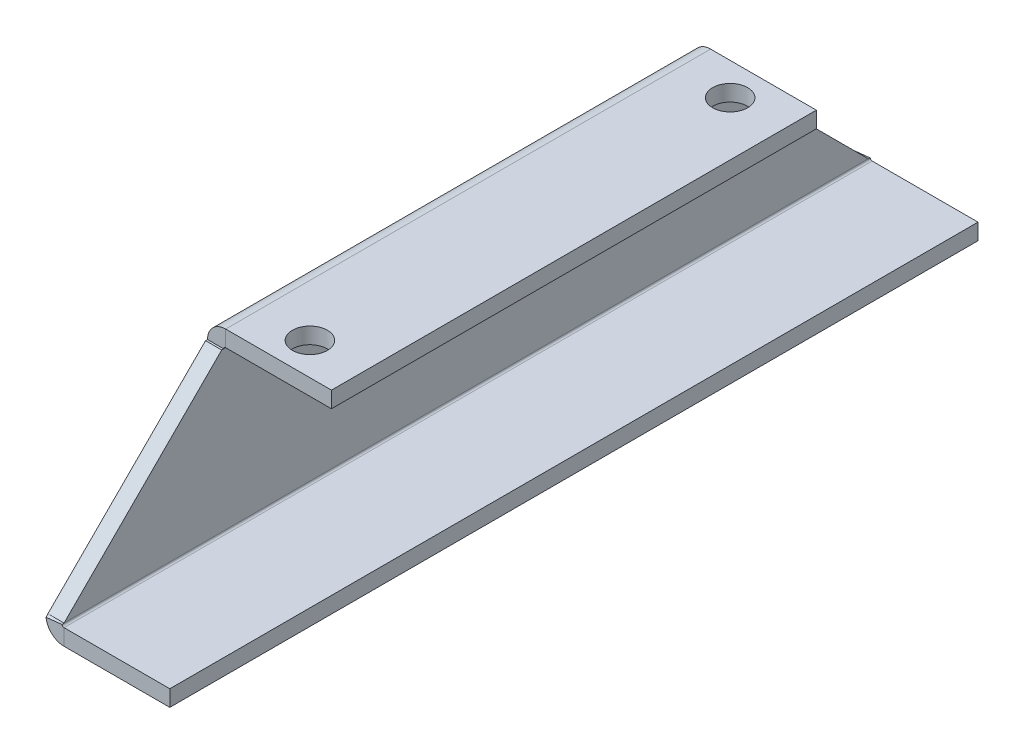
ISO-10303-21;
HEADER;
FILE_DESCRIPTION(('STEP AP214'),'2;1');
FILE_NAME('part.step','',(''),(''),'','','');
FILE_SCHEMA(('AUTOMOTIVE_DESIGN { 1 0 10303 214 1 1 1 1 }'));
ENDSEC;
DATA;
#1=APPLICATION_CONTEXT('core data for automotive mechanical design processes');
#2=APPLICATION_PROTOCOL_DEFINITION('international standard','automotive_design',2000,#1);
#3=PRODUCT_CONTEXT('',#1,'mechanical');
#4=PRODUCT('Part','Part','',(#3));
#5=PRODUCT_RELATED_PRODUCT_CATEGORY('part','',(#4));
#6=PRODUCT_DEFINITION_FORMATION('','',#4);
#7=PRODUCT_DEFINITION_CONTEXT('part definition',#1,'design');
#8=PRODUCT_DEFINITION('design','',#6,#7);
#9=PRODUCT_DEFINITION_SHAPE('','',#8);
#10=(LENGTH_UNIT() NAMED_UNIT(*) SI_UNIT(.MILLI.,.METRE.));
#11=(NAMED_UNIT(*) PLANE_ANGLE_UNIT() SI_UNIT($,.RADIAN.));
#12=(NAMED_UNIT(*) SI_UNIT($,.STERADIAN.) SOLID_ANGLE_UNIT());
#13=UNCERTAINTY_MEASURE_WITH_UNIT(LENGTH_MEASURE(1.E-05),#10,'distance_accuracy_value','');
#14=(GEOMETRIC_REPRESENTATION_CONTEXT(3) GLOBAL_UNCERTAINTY_ASSIGNED_CONTEXT((#13)) GLOBAL_UNIT_ASSIGNED_CONTEXT((#10,
#11,#12)) REPRESENTATION_CONTEXT('',''));
#15=CARTESIAN_POINT('',(0.,0.,0.));
#16=DIRECTION('',(0.,0.,1.));
#17=DIRECTION('',(1.,0.,0.));
#18=AXIS2_PLACEMENT_3D('',#15,#16,#17);
#19=CARTESIAN_POINT('',(0.,34.,150.));
#20=DIRECTION('',(1.,0.,0.));
#21=DIRECTION('',(0.,1.,0.));
#22=AXIS2_PLACEMENT_3D('',#19,#20,#21);
#23=PLANE('',#22);
#24=DIRECTION('',(0.,-0.707106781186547,-0.707106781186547));
#25=VECTOR('',#24,1.);
#26=CARTESIAN_POINT('',(0.,154.,30.));
#27=LINE('',#26,#25);
#28=CARTESIAN_POINT('',(0.,33.2634,-90.7365999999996));
#29=VERTEX_POINT('',#28);
#30=CARTESIAN_POINT('',(0.,-25.2634,-149.2634));
#31=VERTEX_POINT('',#30);
#32=EDGE_CURVE('E164',#29,#31,#27,.T.);
#33=ORIENTED_EDGE('',*,*,#32,.F.);
#34=DIRECTION('',(0.,0.,1.));
#35=VECTOR('',#34,1.);
#36=CARTESIAN_POINT('',(0.,33.2634,-97.9999999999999));
#37=LINE('',#36,#35);
#38=CARTESIAN_POINT('',(0.,33.2634,-89.9999999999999));
#39=VERTEX_POINT('',#38);
#40=EDGE_CURVE('E167',#29,#39,#37,.T.);
#41=ORIENTED_EDGE('',*,*,#40,.T.);
#42=DIRECTION('',(0.,0.,0.999999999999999));
#43=VECTOR('',#42,1.);
#44=CARTESIAN_POINT('',(0.,33.2633999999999,89.9999999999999));
#45=LINE('',#44,#43);
#46=CARTESIAN_POINT('',(0.,33.2633999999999,90.0000000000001));
#47=VERTEX_POINT('',#46);
#48=EDGE_CURVE('E230',#47,#39,#45,.F.);
#49=ORIENTED_EDGE('',*,*,#48,.F.);
#50=DIRECTION('',(0.,0.,-1.));
#51=VECTOR('',#50,1.);
#52=CARTESIAN_POINT('',(0.,33.2633999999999,97.9999999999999));
#53=LINE('',#52,#51);
#54=CARTESIAN_POINT('',(0.,33.2633999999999,90.7366000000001));
#55=VERTEX_POINT('',#54);
#56=EDGE_CURVE('E193',#55,#47,#53,.T.);
#57=ORIENTED_EDGE('',*,*,#56,.F.);
#58=DIRECTION('',(0.,0.707106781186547,-0.707106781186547));
#59=VECTOR('',#58,1.);
#60=CARTESIAN_POINT('',(0.,4.,120.));
#61=LINE('',#60,#59);
#62=CARTESIAN_POINT('',(0.,-25.2634,149.2634));
#63=VERTEX_POINT('',#62);
#64=EDGE_CURVE('E72',#63,#55,#61,.T.);
#65=ORIENTED_EDGE('',*,*,#64,.F.);
#66=DIRECTION('',(0.,0.,-1.));
#67=VECTOR('',#66,1.);
#68=CARTESIAN_POINT('',(0.,-25.2634,150.));
#69=LINE('',#68,#67);
#70=EDGE_CURVE('E170',#63,#31,#69,.T.);
#71=ORIENTED_EDGE('',*,*,#70,.T.);
#72=EDGE_LOOP('',(#33,#41,#49,#57,#65,#71));
#73=FACE_BOUND('',#72,.T.);
#74=ADVANCED_FACE('F47',(#73),#23,.T.);
#75=CARTESIAN_POINT('',(-6.00000000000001,34.,150.));
#76=DIRECTION('',(1.,0.,0.));
#77=DIRECTION('',(0.,1.,0.));
#78=AXIS2_PLACEMENT_3D('',#75,#76,#77);
#79=PLANE('',#78);
#80=DIRECTION('',(0.,0.,1.));
#81=VECTOR('',#80,1.);
#82=CARTESIAN_POINT('',(-6.00000000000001,33.2634,-97.9999999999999));
#83=LINE('',#82,#81);
#84=CARTESIAN_POINT('',(-6.00000000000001,33.2634,-90.7365999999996));
#85=VERTEX_POINT('',#84);
#86=CARTESIAN_POINT('',(-6.00000000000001,33.2634,-89.9999999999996));
#87=VERTEX_POINT('',#86);
#88=EDGE_CURVE('E184',#85,#87,#83,.T.);
#89=ORIENTED_EDGE('',*,*,#88,.F.);
#90=DIRECTION('',(0.,-0.707106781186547,-0.707106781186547));
#91=VECTOR('',#90,1.);
#92=CARTESIAN_POINT('',(-6.00000000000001,154.,30.));
#93=LINE('',#92,#91);
#94=CARTESIAN_POINT('',(-6.00000000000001,-25.2634,-149.2634));
#95=VERTEX_POINT('',#94);
#96=EDGE_CURVE('E64',#85,#95,#93,.T.);
#97=ORIENTED_EDGE('',*,*,#96,.T.);
#98=DIRECTION('',(0.,0.,-1.));
#99=VECTOR('',#98,1.);
#100=CARTESIAN_POINT('',(-6.00000000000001,-25.2634,150.));
#101=LINE('',#100,#99);
#102=CARTESIAN_POINT('',(-6.00000000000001,-25.2634,149.2634));
#103=VERTEX_POINT('',#102);
#104=EDGE_CURVE('E296',#103,#95,#101,.T.);
#105=ORIENTED_EDGE('',*,*,#104,.F.);
#106=DIRECTION('',(0.,0.707106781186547,-0.707106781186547));
#107=VECTOR('',#106,1.);
#108=CARTESIAN_POINT('',(-6.00000000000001,4.,120.));
#109=LINE('',#108,#107);
#110=CARTESIAN_POINT('',(-6.00000000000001,33.2633999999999,90.7366000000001));
#111=VERTEX_POINT('',#110);
#112=EDGE_CURVE('E253',#103,#111,#109,.T.);
#113=ORIENTED_EDGE('',*,*,#112,.T.);
#114=DIRECTION('',(0.,0.,-1.));
#115=VECTOR('',#114,1.);
#116=CARTESIAN_POINT('',(-6.00000000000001,33.2633999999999,97.9999999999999));
#117=LINE('',#116,#115);
#118=CARTESIAN_POINT('',(-6.00000000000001,33.2633999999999,90.0000000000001));
#119=VERTEX_POINT('',#118);
#120=EDGE_CURVE('E191',#111,#119,#117,.T.);
#121=ORIENTED_EDGE('',*,*,#120,.T.);
#122=DIRECTION('',(0.,0.,0.999999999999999));
#123=VECTOR('',#122,1.);
#124=CARTESIAN_POINT('',(-6.00000000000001,33.2633999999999,89.9999999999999));
#125=LINE('',#124,#123);
#126=EDGE_CURVE('E234',#119,#87,#125,.F.);
#127=ORIENTED_EDGE('',*,*,#126,.T.);
#128=EDGE_LOOP('',(#89,#97,#105,#113,#121,#127));
#129=FACE_BOUND('',#128,.T.);
#130=ADVANCED_FACE('F367',(#129),#79,.F.);
#131=CARTESIAN_POINT('',(0.,33.2634,-97.9999999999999));
#132=DIRECTION('',(0.,1.,0.));
#133=DIRECTION('',(0.,0.,1.));
#134=AXIS2_PLACEMENT_3D('',#131,#132,#133);
#135=PLANE('',#134);
#136=ORIENTED_EDGE('',*,*,#40,.F.);
#137=DIRECTION('',(1.,0.,0.));
#138=VECTOR('',#137,1.);
#139=CARTESIAN_POINT('',(0.,33.2634,-90.7365999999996));
#140=LINE('',#139,#138);
#141=EDGE_CURVE('E174',#29,#85,#140,.F.);
#142=ORIENTED_EDGE('',*,*,#141,.T.);
#143=ORIENTED_EDGE('',*,*,#88,.T.);
#144=DIRECTION('',(-1.,0.,0.));
#145=VECTOR('',#144,1.);
#146=CARTESIAN_POINT('',(0.,33.2634,-89.9999999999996));
#147=LINE('',#146,#145);
#148=EDGE_CURVE('E182',#39,#87,#147,.T.);
#149=ORIENTED_EDGE('',*,*,#148,.F.);
#150=EDGE_LOOP('',(#136,#142,#143,#149));
#151=FACE_BOUND('',#150,.T.);
#152=ADVANCED_FACE('F180',(#151),#135,.T.);
#153=CARTESIAN_POINT('',(0.,33.2633999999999,97.9999999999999));
#154=DIRECTION('',(0.,-1.,0.));
#155=DIRECTION('',(0.,0.,-1.));
#156=AXIS2_PLACEMENT_3D('',#153,#154,#155);
#157=PLANE('',#156);
#158=DIRECTION('',(-1.,0.,0.));
#159=VECTOR('',#158,1.);
#160=CARTESIAN_POINT('',(-6.00000000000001,33.2633999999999,90.7366000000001));
#161=LINE('',#160,#159);
#162=EDGE_CURVE('E186',#111,#55,#161,.F.);
#163=ORIENTED_EDGE('',*,*,#162,.T.);
#164=ORIENTED_EDGE('',*,*,#56,.T.);
#165=DIRECTION('',(-1.,0.,0.));
#166=VECTOR('',#165,1.);
#167=CARTESIAN_POINT('',(0.,33.2633999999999,90.0000000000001));
#168=LINE('',#167,#166);
#169=EDGE_CURVE('E240',#47,#119,#168,.T.);
#170=ORIENTED_EDGE('',*,*,#169,.T.);
#171=ORIENTED_EDGE('',*,*,#120,.F.);
#172=EDGE_LOOP('',(#163,#164,#170,#171));
#173=FACE_BOUND('',#172,.T.);
#174=ADVANCED_FACE('F460',(#173),#157,.F.);
#175=CARTESIAN_POINT('',(-6.00000000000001,4.,120.));
#176=DIRECTION('',(0.,-0.707106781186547,-0.707106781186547));
#177=DIRECTION('',(0.,0.707106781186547,-0.707106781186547));
#178=AXIS2_PLACEMENT_3D('',#175,#176,#177);
#179=PLANE('',#178);
#180=ORIENTED_EDGE('',*,*,#64,.T.);
#181=ORIENTED_EDGE('',*,*,#162,.F.);
#182=ORIENTED_EDGE('',*,*,#112,.F.);
#183=DIRECTION('',(-1.,0.,0.));
#184=VECTOR('',#183,1.);
#185=CARTESIAN_POINT('',(-6.00000000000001,-25.2634,149.2634));
#186=LINE('',#185,#184);
#187=EDGE_CURVE('E256',#103,#63,#186,.F.);
#188=ORIENTED_EDGE('',*,*,#187,.T.);
#189=EDGE_LOOP('',(#180,#181,#182,#188));
#190=FACE_BOUND('',#189,.T.);
#191=ADVANCED_FACE('F452',(#190),#179,.F.);
#192=CARTESIAN_POINT('',(-6.00000000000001,154.,30.));
#193=DIRECTION('',(0.,-0.707106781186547,0.707106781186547));
#194=DIRECTION('',(0.,-0.707106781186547,-0.707106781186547));
#195=AXIS2_PLACEMENT_3D('',#192,#193,#194);
#196=PLANE('',#195);
#197=ORIENTED_EDGE('',*,*,#96,.F.);
#198=ORIENTED_EDGE('',*,*,#141,.F.);
#199=ORIENTED_EDGE('',*,*,#32,.T.);
#200=DIRECTION('',(-1.,0.,0.));
#201=VECTOR('',#200,1.);
#202=CARTESIAN_POINT('',(-6.00000000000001,-25.2634,-149.2634));
#203=LINE('',#202,#201);
#204=EDGE_CURVE('E172',#95,#31,#203,.F.);
#205=ORIENTED_EDGE('',*,*,#204,.F.);
#206=EDGE_LOOP('',(#197,#198,#199,#205));
#207=FACE_BOUND('',#206,.T.);
#208=ADVANCED_FACE('F175',(#207),#196,.F.);
#209=CARTESIAN_POINT('',(0.736599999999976,-25.2634,150.));
#210=DIRECTION('',(0.,0.,-1.));
#211=DIRECTION('',(-1.,0.,0.));
#212=AXIS2_PLACEMENT_3D('',#209,#210,#211);
#213=CYLINDRICAL_SURFACE('',#212,0.7366);
#214=ORIENTED_EDGE('',*,*,#70,.F.);
#215=CARTESIAN_POINT('',(0.736599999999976,-25.2634,149.2634));
#216=DIRECTION('',(0.,-0.994075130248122,-0.108695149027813));
#217=DIRECTION('',(0.,0.108695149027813,-0.994075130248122));
#218=AXIS2_PLACEMENT_3D('',#215,#216,#217);
#219=ELLIPSE('',#218,6.7767513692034,0.7366);
#220=CARTESIAN_POINT('',(0.0044165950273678,-25.3439420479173,150.));
#221=VERTEX_POINT('',#220);
#222=EDGE_CURVE('E249',#221,#63,#219,.T.);
#223=ORIENTED_EDGE('',*,*,#222,.F.);
#224=CARTESIAN_POINT('',(0.736599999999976,-25.2634,150.));
#225=DIRECTION('',(0.,0.,-1.));
#226=DIRECTION('',(-1.,0.,0.));
#227=AXIS2_PLACEMENT_3D('',#224,#225,#226);
#228=CIRCLE('',#227,0.7366);
#229=CARTESIAN_POINT('',(0.736599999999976,-26.,150.));
#230=VERTEX_POINT('',#229);
#231=EDGE_CURVE('E289',#221,#230,#228,.F.);
#232=ORIENTED_EDGE('',*,*,#231,.T.);
#233=DIRECTION('',(0.,0.,-1.));
#234=VECTOR('',#233,1.);
#235=CARTESIAN_POINT('',(0.736599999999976,-26.,150.));
#236=LINE('',#235,#234);
#237=CARTESIAN_POINT('',(0.736599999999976,-26.,-150.));
#238=VERTEX_POINT('',#237);
#239=EDGE_CURVE('E300',#230,#238,#236,.T.);
#240=ORIENTED_EDGE('',*,*,#239,.T.);
#241=CARTESIAN_POINT('',(0.736599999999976,-25.2634,-150.));
#242=DIRECTION('',(0.,0.,-1.));
#243=DIRECTION('',(-1.,0.,0.));
#244=AXIS2_PLACEMENT_3D('',#241,#242,#243);
#245=CIRCLE('',#244,0.7366);
#246=CARTESIAN_POINT('',(0.00441659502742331,-25.3439420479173,-150.));
#247=VERTEX_POINT('',#246);
#248=EDGE_CURVE('E277',#247,#238,#245,.F.);
#249=ORIENTED_EDGE('',*,*,#248,.F.);
#250=CARTESIAN_POINT('',(0.736599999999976,-25.2634,-149.2634));
#251=DIRECTION('',(0.,-0.994075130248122,0.108695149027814));
#252=DIRECTION('',(0.,-0.108695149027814,-0.994075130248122));
#253=AXIS2_PLACEMENT_3D('',#250,#251,#252);
#254=ELLIPSE('',#253,6.77675136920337,0.7366);
#255=EDGE_CURVE('E261',#31,#247,#254,.T.);
#256=ORIENTED_EDGE('',*,*,#255,.F.);
#257=EDGE_LOOP('',(#214,#223,#232,#240,#249,#256));
#258=FACE_BOUND('',#257,.T.);
#259=ADVANCED_FACE('F376',(#258),#213,.F.);
#260=CARTESIAN_POINT('',(0.736599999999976,-25.2634,150.));
#261=DIRECTION('',(0.,0.,-1.));
#262=DIRECTION('',(-1.,0.,0.));
#263=AXIS2_PLACEMENT_3D('',#260,#261,#262);
#264=CYLINDRICAL_SURFACE('',#263,6.7366);
#265=CARTESIAN_POINT('',(0.736599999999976,-25.2634,149.2634));
#266=DIRECTION('',(0.,-0.707106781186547,-0.707106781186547));
#267=DIRECTION('',(0.,0.707106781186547,-0.707106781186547));
#268=AXIS2_PLACEMENT_3D('',#265,#266,#267);
#269=ELLIPSE('',#268,9.52699108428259,6.7366);
#270=CARTESIAN_POINT('',(-5.95960788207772,-26.,150.));
#271=VERTEX_POINT('',#270);
#272=EDGE_CURVE('E244',#271,#103,#269,.T.);
#273=ORIENTED_EDGE('',*,*,#272,.T.);
#274=ORIENTED_EDGE('',*,*,#104,.T.);
#275=CARTESIAN_POINT('',(0.736599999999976,-25.2634,-149.2634));
#276=DIRECTION('',(0.,-0.707106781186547,0.707106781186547));
#277=DIRECTION('',(0.,-0.707106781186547,-0.707106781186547));
#278=AXIS2_PLACEMENT_3D('',#275,#276,#277);
#279=ELLIPSE('',#278,9.52699108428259,6.7366);
#280=CARTESIAN_POINT('',(-5.95960788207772,-26.,-150.));
#281=VERTEX_POINT('',#280);
#282=EDGE_CURVE('E258',#95,#281,#279,.T.);
#283=ORIENTED_EDGE('',*,*,#282,.T.);
#284=CARTESIAN_POINT('',(0.736599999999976,-25.2634,-150.));
#285=DIRECTION('',(0.,0.,1.));
#286=DIRECTION('',(1.,0.,0.));
#287=AXIS2_PLACEMENT_3D('',#284,#285,#286);
#288=CIRCLE('',#287,6.7366);
#289=CARTESIAN_POINT('',(0.736599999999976,-32.,-150.));
#290=VERTEX_POINT('',#289);
#291=EDGE_CURVE('E279',#281,#290,#288,.T.);
#292=ORIENTED_EDGE('',*,*,#291,.T.);
#293=DIRECTION('',(0.,0.,-1.));
#294=VECTOR('',#293,1.);
#295=CARTESIAN_POINT('',(0.736599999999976,-32.,150.));
#296=LINE('',#295,#294);
#297=CARTESIAN_POINT('',(0.736599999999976,-32.,150.));
#298=VERTEX_POINT('',#297);
#299=EDGE_CURVE('E293',#298,#290,#296,.T.);
#300=ORIENTED_EDGE('',*,*,#299,.F.);
#301=CARTESIAN_POINT('',(0.736599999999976,-25.2634,150.));
#302=DIRECTION('',(0.,0.,1.));
#303=DIRECTION('',(1.,0.,0.));
#304=AXIS2_PLACEMENT_3D('',#301,#302,#303);
#305=CIRCLE('',#304,6.7366);
#306=EDGE_CURVE('E291',#271,#298,#305,.T.);
#307=ORIENTED_EDGE('',*,*,#306,.F.);
#308=EDGE_LOOP('',(#273,#274,#283,#292,#300,#307));
#309=FACE_BOUND('',#308,.T.);
#310=ADVANCED_FACE('F379',(#309),#264,.T.);
#311=CARTESIAN_POINT('',(0.736599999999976,-26.,150.));
#312=DIRECTION('',(0.,0.,1.));
#313=DIRECTION('',(1.,0.,0.));
#314=AXIS2_PLACEMENT_3D('',#311,#312,#313);
#315=PLANE('',#314);
#316=ORIENTED_EDGE('',*,*,#231,.F.);
#317=DIRECTION('',(-0.994004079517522,-0.109342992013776,0.));
#318=VECTOR('',#317,1.);
#319=CARTESIAN_POINT('',(-5.95960788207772,-26.,150.));
#320=LINE('',#319,#318);
#321=EDGE_CURVE('E251',#271,#221,#320,.F.);
#322=ORIENTED_EDGE('',*,*,#321,.F.);
#323=ORIENTED_EDGE('',*,*,#306,.T.);
#324=DIRECTION('',(0.,-1.,0.));
#325=VECTOR('',#324,1.);
#326=CARTESIAN_POINT('',(0.736599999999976,-26.,150.));
#327=LINE('',#326,#325);
#328=EDGE_CURVE('E11',#230,#298,#327,.T.);
#329=ORIENTED_EDGE('',*,*,#328,.F.);
#330=EDGE_LOOP('',(#316,#322,#323,#329));
#331=FACE_BOUND('',#330,.T.);
#332=ADVANCED_FACE('F49',(#331),#315,.T.);
#333=CARTESIAN_POINT('',(0.,-25.2634,-150.));
#334=DIRECTION('',(0.,0.,-1.));
#335=DIRECTION('',(-1.,0.,0.));
#336=AXIS2_PLACEMENT_3D('',#333,#334,#335);
#337=PLANE('',#336);
#338=ORIENTED_EDGE('',*,*,#291,.F.);
#339=DIRECTION('',(-0.994004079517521,-0.10934299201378,0.));
#340=VECTOR('',#339,1.);
#341=CARTESIAN_POINT('',(-5.95960788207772,-26.,-150.));
#342=LINE('',#341,#340);
#343=EDGE_CURVE('E263',#281,#247,#342,.F.);
#344=ORIENTED_EDGE('',*,*,#343,.T.);
#345=ORIENTED_EDGE('',*,*,#248,.T.);
#346=DIRECTION('',(0.,1.,0.));
#347=VECTOR('',#346,1.);
#348=CARTESIAN_POINT('',(0.736599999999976,-32.,-150.));
#349=LINE('',#348,#347);
#350=EDGE_CURVE('E56',#290,#238,#349,.T.);
#351=ORIENTED_EDGE('',*,*,#350,.F.);
#352=EDGE_LOOP('',(#338,#344,#345,#351));
#353=FACE_BOUND('',#352,.T.);
#354=ADVANCED_FACE('F395',(#353),#337,.T.);
#355=CARTESIAN_POINT('',(-6.00000000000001,-25.2634,150.));
#356=DIRECTION('',(0.,0.,1.));
#357=DIRECTION('',(1.,0.,0.));
#358=AXIS2_PLACEMENT_3D('',#355,#356,#357);
#359=PLANE('',#358);
#360=DIRECTION('',(1.,0.,0.));
#361=VECTOR('',#360,1.);
#362=CARTESIAN_POINT('',(0.,-26.,150.));
#363=LINE('',#362,#361);
#364=CARTESIAN_POINT('',(40.,-26.,150.));
#365=VERTEX_POINT('',#364);
#366=EDGE_CURVE('E286',#230,#365,#363,.T.);
#367=ORIENTED_EDGE('',*,*,#366,.F.);
#368=ORIENTED_EDGE('',*,*,#328,.T.);
#369=DIRECTION('',(1.,0.,0.));
#370=VECTOR('',#369,1.);
#371=CARTESIAN_POINT('',(0.,-32.,150.));
#372=LINE('',#371,#370);
#373=CARTESIAN_POINT('',(40.,-32.0000000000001,150.));
#374=VERTEX_POINT('',#373);
#375=EDGE_CURVE('E281',#298,#374,#372,.T.);
#376=ORIENTED_EDGE('',*,*,#375,.T.);
#377=DIRECTION('',(0.,-1.,0.));
#378=VECTOR('',#377,1.);
#379=CARTESIAN_POINT('',(40.,-26.,150.));
#380=LINE('',#379,#378);
#381=EDGE_CURVE('E283',#365,#374,#380,.T.);
#382=ORIENTED_EDGE('',*,*,#381,.F.);
#383=EDGE_LOOP('',(#367,#368,#376,#382));
#384=FACE_BOUND('',#383,.T.);
#385=ADVANCED_FACE('F393',(#384),#359,.T.);
#386=CARTESIAN_POINT('',(0.,-32.,150.));
#387=DIRECTION('',(0.,1.,0.));
#388=DIRECTION('',(0.,0.,1.));
#389=AXIS2_PLACEMENT_3D('',#386,#387,#388);
#390=PLANE('',#389);
#391=DIRECTION('',(1.,0.,0.));
#392=VECTOR('',#391,1.);
#393=CARTESIAN_POINT('',(0.,-32.,-150.));
#394=LINE('',#393,#392);
#395=CARTESIAN_POINT('',(40.,-32.,-150.));
#396=VERTEX_POINT('',#395);
#397=EDGE_CURVE('E268',#290,#396,#394,.T.);
#398=ORIENTED_EDGE('',*,*,#397,.T.);
#399=DIRECTION('',(0.,0.,-1.));
#400=VECTOR('',#399,1.);
#401=CARTESIAN_POINT('',(40.,-32.0000000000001,150.));
#402=LINE('',#401,#400);
#403=EDGE_CURVE('E305',#374,#396,#402,.T.);
#404=ORIENTED_EDGE('',*,*,#403,.F.);
#405=ORIENTED_EDGE('',*,*,#375,.F.);
#406=ORIENTED_EDGE('',*,*,#299,.T.);
#407=EDGE_LOOP('',(#398,#404,#405,#406));
#408=FACE_BOUND('',#407,.T.);
#409=ADVANCED_FACE('F389',(#408),#390,.F.);
#410=CARTESIAN_POINT('',(40.,-26.,150.));
#411=DIRECTION('',(1.,0.,0.));
#412=DIRECTION('',(0.,0.,-1.));
#413=AXIS2_PLACEMENT_3D('',#410,#411,#412);
#414=PLANE('',#413);
#415=DIRECTION('',(0.,-1.,0.));
#416=VECTOR('',#415,1.);
#417=CARTESIAN_POINT('',(40.,-26.,-150.));
#418=LINE('',#417,#416);
#419=CARTESIAN_POINT('',(40.,-26.,-150.));
#420=VERTEX_POINT('',#419);
#421=EDGE_CURVE('E271',#420,#396,#418,.T.);
#422=ORIENTED_EDGE('',*,*,#421,.F.);
#423=DIRECTION('',(0.,0.,-1.));
#424=VECTOR('',#423,1.);
#425=CARTESIAN_POINT('',(40.,-26.,150.));
#426=LINE('',#425,#424);
#427=EDGE_CURVE('E303',#365,#420,#426,.T.);
#428=ORIENTED_EDGE('',*,*,#427,.F.);
#429=ORIENTED_EDGE('',*,*,#381,.T.);
#430=ORIENTED_EDGE('',*,*,#403,.T.);
#431=EDGE_LOOP('',(#422,#428,#429,#430));
#432=FACE_BOUND('',#431,.T.);
#433=ADVANCED_FACE('F385',(#432),#414,.T.);
#434=CARTESIAN_POINT('',(0.,-26.,150.));
#435=DIRECTION('',(0.,1.,0.));
#436=DIRECTION('',(0.,0.,1.));
#437=AXIS2_PLACEMENT_3D('',#434,#435,#436);
#438=PLANE('',#437);
#439=DIRECTION('',(1.,0.,0.));
#440=VECTOR('',#439,1.);
#441=CARTESIAN_POINT('',(0.,-26.,-150.));
#442=LINE('',#441,#440);
#443=EDGE_CURVE('E274',#238,#420,#442,.T.);
#444=ORIENTED_EDGE('',*,*,#443,.F.);
#445=ORIENTED_EDGE('',*,*,#239,.F.);
#446=ORIENTED_EDGE('',*,*,#366,.T.);
#447=ORIENTED_EDGE('',*,*,#427,.T.);
#448=EDGE_LOOP('',(#444,#445,#446,#447));
#449=FACE_BOUND('',#448,.T.);
#450=ADVANCED_FACE('F381',(#449),#438,.T.);
#451=CARTESIAN_POINT('',(0.736599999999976,-25.2634,-150.));
#452=DIRECTION('',(0.,0.,-1.));
#453=DIRECTION('',(-1.,0.,0.));
#454=AXIS2_PLACEMENT_3D('',#451,#452,#453);
#455=PLANE('',#454);
#456=ORIENTED_EDGE('',*,*,#397,.F.);
#457=ORIENTED_EDGE('',*,*,#350,.T.);
#458=ORIENTED_EDGE('',*,*,#443,.T.);
#459=ORIENTED_EDGE('',*,*,#421,.T.);
#460=EDGE_LOOP('',(#456,#457,#458,#459));
#461=FACE_BOUND('',#460,.T.);
#462=ADVANCED_FACE('F384',(#461),#455,.T.);
#463=CARTESIAN_POINT('',(0.736600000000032,-26.,-156.));
#464=CARTESIAN_POINT('',(0.736599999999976,-28.,-156.));
#465=CARTESIAN_POINT('',(0.736599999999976,-30.,-156.));
#466=CARTESIAN_POINT('',(0.736599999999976,-32.,-156.));
#467=CARTESIAN_POINT('',(2.20980000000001,-26.,-156.));
#468=CARTESIAN_POINT('',(6.20979999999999,-28.,-155.999999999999));
#469=CARTESIAN_POINT('',(10.2098,-30.,-156.));
#470=CARTESIAN_POINT('',(14.2098,-32.,-156.));
#471=CARTESIAN_POINT('',(2.20980000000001,-24.5267999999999,-142.5268));
#472=CARTESIAN_POINT('',(6.20979999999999,-22.5267999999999,-142.526799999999));
#473=CARTESIAN_POINT('',(10.2098,-20.5268,-142.526799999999));
#474=CARTESIAN_POINT('',(14.2098,-18.5268,-142.526799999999));
#475=CARTESIAN_POINT('',(0.736599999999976,-24.5268,-142.5268));
#476=CARTESIAN_POINT('',(0.736600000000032,-22.5268,-142.5268));
#477=CARTESIAN_POINT('',(0.736600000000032,-20.5268,-142.5268));
#478=CARTESIAN_POINT('',(0.736599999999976,-18.5268,-142.5268));
#479=CARTESIAN_POINT('',(-0.736599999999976,-24.5267999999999,-142.5268));
#480=CARTESIAN_POINT('',(-4.73660000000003,-22.5267999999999,-142.526799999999));
#481=CARTESIAN_POINT('',(-8.73660000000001,-20.5267999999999,-142.526799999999));
#482=CARTESIAN_POINT('',(-12.7366,-18.5267999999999,-142.526799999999));
#483=CARTESIAN_POINT('',(-0.736599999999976,-26.,-156.));
#484=CARTESIAN_POINT('',(-4.73660000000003,-28.,-155.999999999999));
#485=CARTESIAN_POINT('',(-8.73660000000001,-29.9999999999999,-156.));
#486=CARTESIAN_POINT('',(-12.7366,-31.9999999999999,-156.));
#487=CARTESIAN_POINT('',(0.736600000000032,-26.,-156.));
#488=CARTESIAN_POINT('',(0.736599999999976,-28.,-156.));
#489=CARTESIAN_POINT('',(0.736599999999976,-30.,-156.));
#490=CARTESIAN_POINT('',(0.736599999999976,-32.,-156.));
#491=(BOUNDED_SURFACE() B_SPLINE_SURFACE(3,3,((#463,#464,#465,#466),(#467,#468,#469,#470),(#471,
#472,#473,#474),(#475,#476,#477,#478),(#479,#480,#481,#482),(#483,#484,#485,#486),(#487,#488,
#489,#490)),.UNSPECIFIED.,.T.,.F.,.F.) B_SPLINE_SURFACE_WITH_KNOTS((4,3,4),(4,4),(0.,0.5,1.),
(0.,1.),.UNSPECIFIED.) GEOMETRIC_REPRESENTATION_ITEM() RATIONAL_B_SPLINE_SURFACE(((1.,1.,1.,1.),
(0.333333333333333,0.333333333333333,0.333333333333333,0.333333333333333),(0.333333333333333,
0.333333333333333,0.333333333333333,0.333333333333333),(1.,1.,1.,1.),(0.333333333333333,
0.333333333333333,0.333333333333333,0.333333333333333),(0.333333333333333,0.333333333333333,
0.333333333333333,0.333333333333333),(1.,1.,1.,1.))) REPRESENTATION_ITEM('') SURFACE());
#492=ORIENTED_EDGE('',*,*,#343,.F.);
#493=ORIENTED_EDGE('',*,*,#282,.F.);
#494=ORIENTED_EDGE('',*,*,#204,.T.);
#495=ORIENTED_EDGE('',*,*,#255,.T.);
#496=EDGE_LOOP('',(#492,#493,#494,#495));
#497=FACE_BOUND('',#496,.T.);
#498=ADVANCED_FACE('F426',(#497),#491,.T.);
#499=CARTESIAN_POINT('',(0.736599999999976,-24.5268,142.5268));
#500=CARTESIAN_POINT('',(0.736599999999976,-22.5268,142.5268));
#501=CARTESIAN_POINT('',(0.736599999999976,-20.5268,142.5268));
#502=CARTESIAN_POINT('',(0.736599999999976,-18.5268,142.5268));
#503=CARTESIAN_POINT('',(2.20980000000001,-24.5268,142.5268));
#504=CARTESIAN_POINT('',(6.20979999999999,-22.5268,142.5268));
#505=CARTESIAN_POINT('',(10.2098,-20.5268000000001,142.5268));
#506=CARTESIAN_POINT('',(14.2098,-18.5268000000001,142.5268));
#507=CARTESIAN_POINT('',(2.20980000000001,-26.,156.));
#508=CARTESIAN_POINT('',(6.20979999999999,-28.,156.));
#509=CARTESIAN_POINT('',(10.2098,-30.,156.));
#510=CARTESIAN_POINT('',(14.2098,-32.,156.));
#511=CARTESIAN_POINT('',(0.736599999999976,-26.,156.));
#512=CARTESIAN_POINT('',(0.736599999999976,-28.,156.));
#513=CARTESIAN_POINT('',(0.736599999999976,-30.,156.));
#514=CARTESIAN_POINT('',(0.736599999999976,-32.,156.));
#515=CARTESIAN_POINT('',(-0.736599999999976,-26.,156.));
#516=CARTESIAN_POINT('',(-4.73660000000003,-28.,156.));
#517=CARTESIAN_POINT('',(-8.73660000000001,-30.,156.));
#518=CARTESIAN_POINT('',(-12.7366,-32.,156.));
#519=CARTESIAN_POINT('',(-0.736599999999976,-24.5268,142.5268));
#520=CARTESIAN_POINT('',(-4.73660000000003,-22.5268,142.5268));
#521=CARTESIAN_POINT('',(-8.73660000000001,-20.5268,142.5268));
#522=CARTESIAN_POINT('',(-12.7366,-18.5268,142.5268));
#523=CARTESIAN_POINT('',(0.736599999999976,-24.5268,142.5268));
#524=CARTESIAN_POINT('',(0.736599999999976,-22.5268,142.5268));
#525=CARTESIAN_POINT('',(0.736599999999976,-20.5268,142.5268));
#526=CARTESIAN_POINT('',(0.736599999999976,-18.5268,142.5268));
#527=(BOUNDED_SURFACE() B_SPLINE_SURFACE(3,3,((#499,#500,#501,#502),(#503,#504,#505,#506),(#507,
#508,#509,#510),(#511,#512,#513,#514),(#515,#516,#517,#518),(#519,#520,#521,#522),(#523,#524,
#525,#526)),.UNSPECIFIED.,.T.,.F.,.F.) B_SPLINE_SURFACE_WITH_KNOTS((4,3,4),(4,4),(0.,0.5,1.),
(0.,1.),.UNSPECIFIED.) GEOMETRIC_REPRESENTATION_ITEM() RATIONAL_B_SPLINE_SURFACE(((1.,1.,1.,1.),
(0.333333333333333,0.333333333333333,0.333333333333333,0.333333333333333),(0.333333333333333,
0.333333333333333,0.333333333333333,0.333333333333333),(1.,1.,1.,1.),(0.333333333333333,
0.333333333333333,0.333333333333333,0.333333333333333),(0.333333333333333,0.333333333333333,
0.333333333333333,0.333333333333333),(1.,1.,1.,1.))) REPRESENTATION_ITEM('') SURFACE());
#528=ORIENTED_EDGE('',*,*,#187,.F.);
#529=ORIENTED_EDGE('',*,*,#272,.F.);
#530=ORIENTED_EDGE('',*,*,#321,.T.);
#531=ORIENTED_EDGE('',*,*,#222,.T.);
#532=EDGE_LOOP('',(#528,#529,#530,#531));
#533=FACE_BOUND('',#532,.T.);
#534=ADVANCED_FACE('F443',(#533),#527,.T.);
#535=CARTESIAN_POINT('',(0.736599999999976,33.2634,-89.9999999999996));
#536=DIRECTION('',(0.,0.,-0.999999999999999));
#537=DIRECTION('',(-1.,0.,0.));
#538=AXIS2_PLACEMENT_3D('',#535,#536,#537);
#539=PLANE('',#538);
#540=DIRECTION('',(0.,1.,0.));
#541=VECTOR('',#540,1.);
#542=CARTESIAN_POINT('',(0.736599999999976,34.,-89.9999999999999));
#543=LINE('',#542,#541);
#544=CARTESIAN_POINT('',(0.736599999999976,34.,-89.9999999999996));
#545=VERTEX_POINT('',#544);
#546=CARTESIAN_POINT('',(0.736599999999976,40.,-89.9999999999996));
#547=VERTEX_POINT('',#546);
#548=EDGE_CURVE('E195',#545,#547,#543,.T.);
#549=ORIENTED_EDGE('',*,*,#548,.F.);
#550=CARTESIAN_POINT('',(0.736599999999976,33.2634,-89.9999999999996));
#551=DIRECTION('',(0.,0.,0.999999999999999));
#552=DIRECTION('',(1.,0.,0.));
#553=AXIS2_PLACEMENT_3D('',#550,#551,#552);
#554=CIRCLE('',#553,0.736599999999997);
#555=EDGE_CURVE('E226',#39,#545,#554,.F.);
#556=ORIENTED_EDGE('',*,*,#555,.F.);
#557=ORIENTED_EDGE('',*,*,#148,.T.);
#558=CARTESIAN_POINT('',(0.736599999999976,33.2634,-89.9999999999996));
#559=DIRECTION('',(0.,0.,0.999999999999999));
#560=DIRECTION('',(1.,0.,0.));
#561=AXIS2_PLACEMENT_3D('',#558,#559,#560);
#562=CIRCLE('',#561,6.7366);
#563=EDGE_CURVE('E237',#87,#547,#562,.F.);
#564=ORIENTED_EDGE('',*,*,#563,.T.);
#565=EDGE_LOOP('',(#549,#556,#557,#564));
#566=FACE_BOUND('',#565,.T.);
#567=ADVANCED_FACE('F349',(#566),#539,.T.);
#568=CARTESIAN_POINT('',(0.736599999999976,33.2633999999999,90.0000000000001));
#569=DIRECTION('',(0.,0.,-0.999999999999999));
#570=DIRECTION('',(-1.,0.,0.));
#571=AXIS2_PLACEMENT_3D('',#568,#569,#570);
#572=PLANE('',#571);
#573=CARTESIAN_POINT('',(0.736599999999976,33.2633999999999,90.0000000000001));
#574=DIRECTION('',(0.,0.,0.999999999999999));
#575=DIRECTION('',(1.,0.,0.));
#576=AXIS2_PLACEMENT_3D('',#573,#574,#575);
#577=CIRCLE('',#576,0.736599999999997);
#578=CARTESIAN_POINT('',(0.736599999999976,34.,90.0000000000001));
#579=VERTEX_POINT('',#578);
#580=EDGE_CURVE('E225',#579,#47,#577,.T.);
#581=ORIENTED_EDGE('',*,*,#580,.F.);
#582=DIRECTION('',(0.,1.,0.));
#583=VECTOR('',#582,1.);
#584=CARTESIAN_POINT('',(0.736599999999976,34.,90.0000000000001));
#585=LINE('',#584,#583);
#586=CARTESIAN_POINT('',(0.736599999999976,40.,90.0000000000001));
#587=VERTEX_POINT('',#586);
#588=EDGE_CURVE('E198',#579,#587,#585,.T.);
#589=ORIENTED_EDGE('',*,*,#588,.T.);
#590=CARTESIAN_POINT('',(0.736599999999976,33.2633999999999,90.0000000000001));
#591=DIRECTION('',(0.,0.,0.999999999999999));
#592=DIRECTION('',(1.,0.,0.));
#593=AXIS2_PLACEMENT_3D('',#590,#591,#592);
#594=CIRCLE('',#593,6.7366);
#595=EDGE_CURVE('E229',#587,#119,#594,.T.);
#596=ORIENTED_EDGE('',*,*,#595,.T.);
#597=ORIENTED_EDGE('',*,*,#169,.F.);
#598=EDGE_LOOP('',(#581,#589,#596,#597));
#599=FACE_BOUND('',#598,.T.);
#600=ADVANCED_FACE('F432',(#599),#572,.F.);
#601=CARTESIAN_POINT('',(0.736599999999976,33.2633999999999,89.9999999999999));
#602=DIRECTION('',(0.,0.,0.999999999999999));
#603=DIRECTION('',(0.,1.,0.));
#604=AXIS2_PLACEMENT_3D('',#601,#602,#603);
#605=CYLINDRICAL_SURFACE('',#604,6.7366);
#606=ORIENTED_EDGE('',*,*,#126,.F.);
#607=ORIENTED_EDGE('',*,*,#595,.F.);
#608=DIRECTION('',(0.,0.,-1.));
#609=VECTOR('',#608,1.);
#610=CARTESIAN_POINT('',(0.736599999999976,40.,89.9999999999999));
#611=LINE('',#610,#609);
#612=EDGE_CURVE('E201',#587,#547,#611,.T.);
#613=ORIENTED_EDGE('',*,*,#612,.T.);
#614=ORIENTED_EDGE('',*,*,#563,.F.);
#615=EDGE_LOOP('',(#606,#607,#613,#614));
#616=FACE_BOUND('',#615,.T.);
#617=ADVANCED_FACE('F430',(#616),#605,.T.);
#618=CARTESIAN_POINT('',(0.736599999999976,33.2633999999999,89.9999999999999));
#619=DIRECTION('',(0.,0.,0.999999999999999));
#620=DIRECTION('',(0.,1.,0.));
#621=AXIS2_PLACEMENT_3D('',#618,#619,#620);
#622=CYLINDRICAL_SURFACE('',#621,0.736599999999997);
#623=ORIENTED_EDGE('',*,*,#48,.T.);
#624=ORIENTED_EDGE('',*,*,#555,.T.);
#625=DIRECTION('',(0.,0.,0.999999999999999));
#626=VECTOR('',#625,1.);
#627=CARTESIAN_POINT('',(0.736599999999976,34.,-89.9999999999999));
#628=LINE('',#627,#626);
#629=EDGE_CURVE('E196',#545,#579,#628,.T.);
#630=ORIENTED_EDGE('',*,*,#629,.T.);
#631=ORIENTED_EDGE('',*,*,#580,.T.);
#632=EDGE_LOOP('',(#623,#624,#630,#631));
#633=FACE_BOUND('',#632,.T.);
#634=ADVANCED_FACE('F352',(#633),#622,.F.);
#635=CARTESIAN_POINT('',(40.,40.0000000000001,89.9999999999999));
#636=DIRECTION('',(0.,0.,-1.));
#637=DIRECTION('',(-1.,0.,0.));
#638=AXIS2_PLACEMENT_3D('',#635,#636,#637);
#639=PLANE('',#638);
#640=ORIENTED_EDGE('',*,*,#588,.F.);
#641=DIRECTION('',(1.,0.,0.));
#642=VECTOR('',#641,1.);
#643=CARTESIAN_POINT('',(40.,34.0000000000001,89.9999999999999));
#644=LINE('',#643,#642);
#645=CARTESIAN_POINT('',(40.,34.0000000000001,89.9999999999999));
#646=VERTEX_POINT('',#645);
#647=EDGE_CURVE('E205',#579,#646,#644,.T.);
#648=ORIENTED_EDGE('',*,*,#647,.T.);
#649=DIRECTION('',(0.,-1.,0.));
#650=VECTOR('',#649,1.);
#651=CARTESIAN_POINT('',(40.,40.0000000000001,89.9999999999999));
#652=LINE('',#651,#650);
#653=CARTESIAN_POINT('',(40.,40.0000000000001,89.9999999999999));
#654=VERTEX_POINT('',#653);
#655=EDGE_CURVE('E222',#654,#646,#652,.T.);
#656=ORIENTED_EDGE('',*,*,#655,.F.);
#657=DIRECTION('',(1.,0.,0.));
#658=VECTOR('',#657,1.);
#659=CARTESIAN_POINT('',(40.,40.0000000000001,89.9999999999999));
#660=LINE('',#659,#658);
#661=EDGE_CURVE('E212',#587,#654,#660,.T.);
#662=ORIENTED_EDGE('',*,*,#661,.F.);
#663=EDGE_LOOP('',(#640,#648,#656,#662));
#664=FACE_BOUND('',#663,.T.);
#665=ADVANCED_FACE('F339',(#664),#639,.F.);
#666=CARTESIAN_POINT('',(0.,40.,-89.9999999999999));
#667=DIRECTION('',(0.,0.,1.));
#668=DIRECTION('',(1.,0.,0.));
#669=AXIS2_PLACEMENT_3D('',#666,#667,#668);
#670=PLANE('',#669);
#671=ORIENTED_EDGE('',*,*,#548,.T.);
#672=DIRECTION('',(-1.,0.,0.));
#673=VECTOR('',#672,1.);
#674=CARTESIAN_POINT('',(0.,40.,-89.9999999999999));
#675=LINE('',#674,#673);
#676=CARTESIAN_POINT('',(40.,40.,-89.9999999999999));
#677=VERTEX_POINT('',#676);
#678=EDGE_CURVE('E216',#677,#547,#675,.T.);
#679=ORIENTED_EDGE('',*,*,#678,.F.);
#680=DIRECTION('',(0.,-1.,0.));
#681=VECTOR('',#680,1.);
#682=CARTESIAN_POINT('',(40.,40.,-89.9999999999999));
#683=LINE('',#682,#681);
#684=CARTESIAN_POINT('',(40.,34.0000000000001,-89.9999999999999));
#685=VERTEX_POINT('',#684);
#686=EDGE_CURVE('E219',#677,#685,#683,.T.);
#687=ORIENTED_EDGE('',*,*,#686,.T.);
#688=DIRECTION('',(-1.,0.,0.));
#689=VECTOR('',#688,1.);
#690=CARTESIAN_POINT('',(0.,34.,-89.9999999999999));
#691=LINE('',#690,#689);
#692=EDGE_CURVE('E209',#685,#545,#691,.T.);
#693=ORIENTED_EDGE('',*,*,#692,.T.);
#694=EDGE_LOOP('',(#671,#679,#687,#693));
#695=FACE_BOUND('',#694,.T.);
#696=ADVANCED_FACE('F327',(#695),#670,.F.);
#697=CARTESIAN_POINT('',(0.,40.,89.9999999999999));
#698=DIRECTION('',(0.,-1.,0.));
#699=DIRECTION('',(1.,0.,0.));
#700=AXIS2_PLACEMENT_3D('',#697,#698,#699);
#701=PLANE('',#700);
#702=CARTESIAN_POINT('',(20.,40.0000000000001,78.0000000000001));
#703=DIRECTION('',(0.,1.,0.));
#704=DIRECTION('',(-1.,0.,0.));
#705=AXIS2_PLACEMENT_3D('',#702,#703,#704);
#706=CIRCLE('',#705,6.5);
#707=CARTESIAN_POINT('',(13.5,40.,78.0000000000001));
#708=VERTEX_POINT('',#707);
#709=EDGE_CURVE('E316',#708,#708,#706,.T.);
#710=ORIENTED_EDGE('',*,*,#709,.F.);
#711=EDGE_LOOP('',(#710));
#712=FACE_BOUND('',#711,.T.);
#713=CARTESIAN_POINT('',(20.,40.,-77.9999999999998));
#714=DIRECTION('',(0.,1.,0.));
#715=DIRECTION('',(-1.,0.,0.));
#716=AXIS2_PLACEMENT_3D('',#713,#714,#715);
#717=CIRCLE('',#716,6.5);
#718=CARTESIAN_POINT('',(13.4999999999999,40.,-77.9999999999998));
#719=VERTEX_POINT('',#718);
#720=EDGE_CURVE('E309',#719,#719,#717,.T.);
#721=ORIENTED_EDGE('',*,*,#720,.F.);
#722=EDGE_LOOP('',(#721));
#723=FACE_BOUND('',#722,.T.);
#724=ORIENTED_EDGE('',*,*,#612,.F.);
#725=ORIENTED_EDGE('',*,*,#661,.T.);
#726=DIRECTION('',(0.,0.,-0.999999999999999));
#727=VECTOR('',#726,1.);
#728=CARTESIAN_POINT('',(40.,40.,-89.9999999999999));
#729=LINE('',#728,#727);
#730=EDGE_CURVE('E214',#654,#677,#729,.T.);
#731=ORIENTED_EDGE('',*,*,#730,.T.);
#732=ORIENTED_EDGE('',*,*,#678,.T.);
#733=EDGE_LOOP('',(#724,#725,#731,#732));
#734=FACE_BOUND('',#733,.T.);
#735=ADVANCED_FACE('F323',(#712,#723,#734),#701,.F.);
#736=CARTESIAN_POINT('',(0.,34.,89.9999999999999));
#737=DIRECTION('',(0.,-1.,0.));
#738=DIRECTION('',(1.,0.,0.));
#739=AXIS2_PLACEMENT_3D('',#736,#737,#738);
#740=PLANE('',#739);
#741=CARTESIAN_POINT('',(20.,34.0000000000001,78.0000000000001));
#742=DIRECTION('',(0.,-1.,0.));
#743=DIRECTION('',(1.,0.,0.));
#744=AXIS2_PLACEMENT_3D('',#741,#742,#743);
#745=CIRCLE('',#744,6.5);
#746=CARTESIAN_POINT('',(13.5,34.0000000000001,78.0000000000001));
#747=VERTEX_POINT('',#746);
#748=EDGE_CURVE('E51',#747,#747,#745,.T.);
#749=ORIENTED_EDGE('',*,*,#748,.F.);
#750=EDGE_LOOP('',(#749));
#751=FACE_BOUND('',#750,.T.);
#752=CARTESIAN_POINT('',(20.,34.,-77.9999999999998));
#753=DIRECTION('',(0.,-1.,0.));
#754=DIRECTION('',(1.,0.,0.));
#755=AXIS2_PLACEMENT_3D('',#752,#753,#754);
#756=CIRCLE('',#755,6.5);
#757=CARTESIAN_POINT('',(13.5,34.,-77.9999999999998));
#758=VERTEX_POINT('',#757);
#759=EDGE_CURVE('E178',#758,#758,#756,.T.);
#760=ORIENTED_EDGE('',*,*,#759,.F.);
#761=EDGE_LOOP('',(#760));
#762=FACE_BOUND('',#761,.T.);
#763=ORIENTED_EDGE('',*,*,#647,.F.);
#764=ORIENTED_EDGE('',*,*,#629,.F.);
#765=ORIENTED_EDGE('',*,*,#692,.F.);
#766=DIRECTION('',(0.,0.,-0.999999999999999));
#767=VECTOR('',#766,1.);
#768=CARTESIAN_POINT('',(40.,34.0000000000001,-89.9999999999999));
#769=LINE('',#768,#767);
#770=EDGE_CURVE('E207',#646,#685,#769,.T.);
#771=ORIENTED_EDGE('',*,*,#770,.F.);
#772=EDGE_LOOP('',(#763,#764,#765,#771));
#773=FACE_BOUND('',#772,.T.);
#774=ADVANCED_FACE('F326',(#751,#762,#773),#740,.T.);
#775=CARTESIAN_POINT('',(40.,40.,-89.9999999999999));
#776=DIRECTION('',(-1.,0.,0.));
#777=DIRECTION('',(0.,-1.,0.));
#778=AXIS2_PLACEMENT_3D('',#775,#776,#777);
#779=PLANE('',#778);
#780=ORIENTED_EDGE('',*,*,#770,.T.);
#781=ORIENTED_EDGE('',*,*,#686,.F.);
#782=ORIENTED_EDGE('',*,*,#730,.F.);
#783=ORIENTED_EDGE('',*,*,#655,.T.);
#784=EDGE_LOOP('',(#780,#781,#782,#783));
#785=FACE_BOUND('',#784,.T.);
#786=ADVANCED_FACE('F343',(#785),#779,.F.);
#787=CARTESIAN_POINT('',(20.,32.,-77.9999999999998));
#788=DIRECTION('',(0.,1.,0.));
#789=DIRECTION('',(-1.,0.,0.));
#790=AXIS2_PLACEMENT_3D('',#787,#788,#789);
#791=CYLINDRICAL_SURFACE('',#790,6.5);
#792=CARTESIAN_POINT('',(13.5,34.,-77.9999999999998));
#793=CARTESIAN_POINT('',(13.5,34.0625,-77.9999999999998));
#794=CARTESIAN_POINT('',(13.5,34.125,-77.9999999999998));
#795=CARTESIAN_POINT('',(13.5,34.25,-77.9999999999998));
#796=CARTESIAN_POINT('',(13.5,34.3125,-77.9999999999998));
#797=CARTESIAN_POINT('',(13.5,34.4375,-77.9999999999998));
#798=CARTESIAN_POINT('',(13.5,34.5,-77.9999999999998));
#799=CARTESIAN_POINT('',(13.5,34.625,-77.9999999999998));
#800=CARTESIAN_POINT('',(13.4999999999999,34.6875,-77.9999999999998));
#801=CARTESIAN_POINT('',(13.4999999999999,34.8125,-77.9999999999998));
#802=CARTESIAN_POINT('',(13.4999999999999,34.875,-77.9999999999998));
#803=CARTESIAN_POINT('',(13.4999999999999,35.,-77.9999999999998));
#804=CARTESIAN_POINT('',(13.4999999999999,35.0625,-77.9999999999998));
#805=CARTESIAN_POINT('',(13.4999999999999,35.1875,-77.9999999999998));
#806=CARTESIAN_POINT('',(13.4999999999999,35.25,-77.9999999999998));
#807=CARTESIAN_POINT('',(13.4999999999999,35.375,-77.9999999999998));
#808=CARTESIAN_POINT('',(13.4999999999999,35.4375,-77.9999999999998));
#809=CARTESIAN_POINT('',(13.4999999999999,35.5625,-77.9999999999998));
#810=CARTESIAN_POINT('',(13.4999999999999,35.625,-77.9999999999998));
#811=CARTESIAN_POINT('',(13.4999999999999,35.75,-77.9999999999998));
#812=CARTESIAN_POINT('',(13.4999999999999,35.8125,-77.9999999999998));
#813=CARTESIAN_POINT('',(13.4999999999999,35.9375,-77.9999999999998));
#814=CARTESIAN_POINT('',(13.4999999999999,36.,-77.9999999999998));
#815=CARTESIAN_POINT('',(13.4999999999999,36.125,-77.9999999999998));
#816=CARTESIAN_POINT('',(13.4999999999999,36.1875,-77.9999999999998));
#817=CARTESIAN_POINT('',(13.4999999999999,36.3125,-77.9999999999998));
#818=CARTESIAN_POINT('',(13.4999999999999,36.375,-77.9999999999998));
#819=CARTESIAN_POINT('',(13.4999999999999,36.5,-77.9999999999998));
#820=CARTESIAN_POINT('',(13.4999999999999,36.5625,-77.9999999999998));
#821=CARTESIAN_POINT('',(13.4999999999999,36.6875,-77.9999999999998));
#822=CARTESIAN_POINT('',(13.4999999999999,36.75,-77.9999999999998));
#823=CARTESIAN_POINT('',(13.4999999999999,36.875,-77.9999999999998));
#824=CARTESIAN_POINT('',(13.4999999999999,36.9375,-77.9999999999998));
#825=CARTESIAN_POINT('',(13.4999999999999,37.0625,-77.9999999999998));
#826=CARTESIAN_POINT('',(13.4999999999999,37.125,-77.9999999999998));
#827=CARTESIAN_POINT('',(13.4999999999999,37.25,-77.9999999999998));
#828=CARTESIAN_POINT('',(13.4999999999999,37.3125,-77.9999999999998));
#829=CARTESIAN_POINT('',(13.4999999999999,37.4375,-77.9999999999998));
#830=CARTESIAN_POINT('',(13.4999999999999,37.5,-77.9999999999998));
#831=CARTESIAN_POINT('',(13.4999999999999,37.625,-77.9999999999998));
#832=CARTESIAN_POINT('',(13.4999999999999,37.6875,-77.9999999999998));
#833=CARTESIAN_POINT('',(13.4999999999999,37.8125,-77.9999999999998));
#834=CARTESIAN_POINT('',(13.4999999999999,37.875,-77.9999999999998));
#835=CARTESIAN_POINT('',(13.4999999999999,38.,-77.9999999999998));
#836=CARTESIAN_POINT('',(13.4999999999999,38.0625,-77.9999999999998));
#837=CARTESIAN_POINT('',(13.4999999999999,38.1875,-77.9999999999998));
#838=CARTESIAN_POINT('',(13.4999999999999,38.25,-77.9999999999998));
#839=CARTESIAN_POINT('',(13.4999999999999,38.375,-77.9999999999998));
#840=CARTESIAN_POINT('',(13.4999999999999,38.4375,-77.9999999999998));
#841=CARTESIAN_POINT('',(13.4999999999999,38.5625,-77.9999999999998));
#842=CARTESIAN_POINT('',(13.4999999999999,38.625,-77.9999999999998));
#843=CARTESIAN_POINT('',(13.4999999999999,38.75,-77.9999999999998));
#844=CARTESIAN_POINT('',(13.4999999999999,38.8125,-77.9999999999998));
#845=CARTESIAN_POINT('',(13.4999999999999,38.9375,-77.9999999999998));
#846=CARTESIAN_POINT('',(13.4999999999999,39.,-77.9999999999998));
#847=CARTESIAN_POINT('',(13.4999999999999,39.125,-77.9999999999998));
#848=CARTESIAN_POINT('',(13.4999999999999,39.1875,-77.9999999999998));
#849=CARTESIAN_POINT('',(13.4999999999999,39.3125,-77.9999999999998));
#850=CARTESIAN_POINT('',(13.4999999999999,39.375,-77.9999999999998));
#851=CARTESIAN_POINT('',(13.4999999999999,39.5,-77.9999999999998));
#852=CARTESIAN_POINT('',(13.4999999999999,39.5625,-77.9999999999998));
#853=CARTESIAN_POINT('',(13.4999999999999,39.6875,-77.9999999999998));
#854=CARTESIAN_POINT('',(13.4999999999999,39.75,-77.9999999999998));
#855=CARTESIAN_POINT('',(13.4999999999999,39.875,-77.9999999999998));
#856=CARTESIAN_POINT('',(13.4999999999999,39.9375,-77.9999999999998));
#857=CARTESIAN_POINT('',(13.4999999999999,40.,-77.9999999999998));
#858=B_SPLINE_CURVE_WITH_KNOTS('',3,(#792,#793,#794,#795,#796,#797,#798,#799,#800,#801,#802,
#803,#804,#805,#806,#807,#808,#809,#810,#811,#812,#813,#814,#815,#816,#817,#818,#819,#820,#821,
#822,#823,#824,#825,#826,#827,#828,#829,#830,#831,#832,#833,#834,#835,#836,#837,#838,#839,#840,
#841,#842,#843,#844,#845,#846,#847,#848,#849,#850,#851,#852,#853,#854,#855,#856,#857),
.UNSPECIFIED.,.F.,.F.,(4,2,2,2,2,2,2,2,2,2,2,2,2,2,2,2,2,2,2,2,2,2,2,2,2,2,2,2,2,2,2,2,4),(0.,
0.187500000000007,0.375,0.5625,0.750000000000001,0.937500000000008,1.125,1.31250000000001,1.5,
1.68750000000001,1.875,2.06250000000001,2.25,2.43750000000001,2.625,2.81250000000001,3.,3.1875,
3.375,3.56250000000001,3.75,3.93750000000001,4.125,4.31250000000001,4.5,4.68750000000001,4.875,
5.06250000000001,5.25,5.43750000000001,5.62500000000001,5.81250000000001,6.00000000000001),.UNSPECIFIED.);
#859=EDGE_CURVE('BSEAM361',#758,#719,#858,.T.);
#860=ORIENTED_EDGE('',*,*,#759,.T.);
#861=ORIENTED_EDGE('',*,*,#720,.T.);
#862=ORIENTED_EDGE('',*,*,#859,.T.);
#863=ORIENTED_EDGE('',*,*,#859,.F.);
#864=EDGE_LOOP('',(#860,#862,#861,#863));
#865=FACE_BOUND('',#864,.T.);
#866=ADVANCED_FACE('F361',(#865),#791,.F.);
#867=CARTESIAN_POINT('',(20.,32.0000000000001,78.0000000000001));
#868=DIRECTION('',(0.,1.,0.));
#869=DIRECTION('',(-1.,0.,0.));
#870=AXIS2_PLACEMENT_3D('',#867,#868,#869);
#871=CYLINDRICAL_SURFACE('',#870,6.5);
#872=CARTESIAN_POINT('',(13.5,34.0000000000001,78.0000000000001));
#873=CARTESIAN_POINT('',(13.5,34.0625000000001,78.0000000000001));
#874=CARTESIAN_POINT('',(13.5,34.1250000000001,78.0000000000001));
#875=CARTESIAN_POINT('',(13.5,34.2500000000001,78.0000000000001));
#876=CARTESIAN_POINT('',(13.5,34.3125000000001,78.0000000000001));
#877=CARTESIAN_POINT('',(13.5,34.4375000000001,78.0000000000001));
#878=CARTESIAN_POINT('',(13.5,34.5000000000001,78.0000000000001));
#879=CARTESIAN_POINT('',(13.5,34.6250000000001,78.0000000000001));
#880=CARTESIAN_POINT('',(13.5,34.6875000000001,78.0000000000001));
#881=CARTESIAN_POINT('',(13.5,34.8125000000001,78.0000000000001));
#882=CARTESIAN_POINT('',(13.5,34.8750000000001,78.0000000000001));
#883=CARTESIAN_POINT('',(13.5,35.0000000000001,78.0000000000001));
#884=CARTESIAN_POINT('',(13.5,35.0625000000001,78.0000000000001));
#885=CARTESIAN_POINT('',(13.5,35.1875000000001,78.0000000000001));
#886=CARTESIAN_POINT('',(13.5,35.2500000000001,78.0000000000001));
#887=CARTESIAN_POINT('',(13.5,35.3750000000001,78.0000000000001));
#888=CARTESIAN_POINT('',(13.5,35.4375000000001,78.0000000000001));
#889=CARTESIAN_POINT('',(13.5,35.5625000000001,78.0000000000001));
#890=CARTESIAN_POINT('',(13.5,35.625,78.0000000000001));
#891=CARTESIAN_POINT('',(13.5,35.75,78.0000000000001));
#892=CARTESIAN_POINT('',(13.5,35.8125,78.0000000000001));
#893=CARTESIAN_POINT('',(13.5,35.9375,78.0000000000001));
#894=CARTESIAN_POINT('',(13.5,36.,78.0000000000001));
#895=CARTESIAN_POINT('',(13.5,36.125,78.0000000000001));
#896=CARTESIAN_POINT('',(13.5,36.1875,78.0000000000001));
#897=CARTESIAN_POINT('',(13.5,36.3125,78.0000000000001));
#898=CARTESIAN_POINT('',(13.5,36.375,78.0000000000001));
#899=CARTESIAN_POINT('',(13.5,36.5,78.0000000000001));
#900=CARTESIAN_POINT('',(13.5,36.5625000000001,78.0000000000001));
#901=CARTESIAN_POINT('',(13.5,36.6875000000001,78.0000000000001));
#902=CARTESIAN_POINT('',(13.5,36.7500000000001,78.0000000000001));
#903=CARTESIAN_POINT('',(13.5,36.8750000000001,78.0000000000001));
#904=CARTESIAN_POINT('',(13.5,36.9375,78.0000000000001));
#905=CARTESIAN_POINT('',(13.5,37.0625,78.0000000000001));
#906=CARTESIAN_POINT('',(13.5,37.125,78.0000000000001));
#907=CARTESIAN_POINT('',(13.5,37.25,78.0000000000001));
#908=CARTESIAN_POINT('',(13.5,37.3125,78.0000000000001));
#909=CARTESIAN_POINT('',(13.5,37.4375,78.0000000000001));
#910=CARTESIAN_POINT('',(13.5,37.5,78.0000000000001));
#911=CARTESIAN_POINT('',(13.5,37.625,78.0000000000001));
#912=CARTESIAN_POINT('',(13.5,37.6875,78.0000000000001));
#913=CARTESIAN_POINT('',(13.5,37.8125,78.0000000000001));
#914=CARTESIAN_POINT('',(13.5,37.875,78.0000000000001));
#915=CARTESIAN_POINT('',(13.5,38.,78.0000000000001));
#916=CARTESIAN_POINT('',(13.5,38.0625,78.0000000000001));
#917=CARTESIAN_POINT('',(13.5,38.1875,78.0000000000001));
#918=CARTESIAN_POINT('',(13.5,38.25,78.0000000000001));
#919=CARTESIAN_POINT('',(13.5,38.375,78.0000000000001));
#920=CARTESIAN_POINT('',(13.5,38.4375,78.0000000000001));
#921=CARTESIAN_POINT('',(13.5,38.5625,78.0000000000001));
#922=CARTESIAN_POINT('',(13.5,38.625,78.0000000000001));
#923=CARTESIAN_POINT('',(13.5,38.75,78.0000000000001));
#924=CARTESIAN_POINT('',(13.5,38.8125,78.0000000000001));
#925=CARTESIAN_POINT('',(13.5,38.9375,78.0000000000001));
#926=CARTESIAN_POINT('',(13.5,39.,78.0000000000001));
#927=CARTESIAN_POINT('',(13.5,39.125,78.0000000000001));
#928=CARTESIAN_POINT('',(13.5,39.1875,78.0000000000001));
#929=CARTESIAN_POINT('',(13.5,39.3125,78.0000000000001));
#930=CARTESIAN_POINT('',(13.5,39.375,78.0000000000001));
#931=CARTESIAN_POINT('',(13.5,39.5,78.0000000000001));
#932=CARTESIAN_POINT('',(13.5,39.5625,78.0000000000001));
#933=CARTESIAN_POINT('',(13.5,39.6875,78.0000000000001));
#934=CARTESIAN_POINT('',(13.5,39.75,78.0000000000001));
#935=CARTESIAN_POINT('',(13.5,39.875,78.0000000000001));
#936=CARTESIAN_POINT('',(13.5,39.9375,78.0000000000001));
#937=CARTESIAN_POINT('',(13.5,40.,78.0000000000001));
#938=B_SPLINE_CURVE_WITH_KNOTS('',3,(#872,#873,#874,#875,#876,#877,#878,#879,#880,#881,#882,
#883,#884,#885,#886,#887,#888,#889,#890,#891,#892,#893,#894,#895,#896,#897,#898,#899,#900,#901,
#902,#903,#904,#905,#906,#907,#908,#909,#910,#911,#912,#913,#914,#915,#916,#917,#918,#919,#920,
#921,#922,#923,#924,#925,#926,#927,#928,#929,#930,#931,#932,#933,#934,#935,#936,#937),
.UNSPECIFIED.,.F.,.F.,(4,2,2,2,2,2,2,2,2,2,2,2,2,2,2,2,2,2,2,2,2,2,2,2,2,2,2,2,2,2,2,2,4),(0.,
0.1875,0.375,0.5625,0.750000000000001,0.937500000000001,1.125,1.3125,1.5,1.68749999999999,
1.87499999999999,2.06249999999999,2.25,2.4375,2.625,2.8125,2.99999999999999,3.18749999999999,
3.37499999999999,3.56249999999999,3.74999999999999,3.93749999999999,4.12499999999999,
4.31249999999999,4.49999999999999,4.68749999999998,4.87499999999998,5.06249999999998,
5.24999999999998,5.43749999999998,5.62499999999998,5.81249999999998,5.99999999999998),.UNSPECIFIED.);
#939=EDGE_CURVE('BSEAM321',#747,#708,#938,.T.);
#940=ORIENTED_EDGE('',*,*,#748,.T.);
#941=ORIENTED_EDGE('',*,*,#709,.T.);
#942=ORIENTED_EDGE('',*,*,#939,.T.);
#943=ORIENTED_EDGE('',*,*,#939,.F.);
#944=EDGE_LOOP('',(#940,#942,#941,#943));
#945=FACE_BOUND('',#944,.T.);
#946=ADVANCED_FACE('F321',(#945),#871,.F.);
#947=CLOSED_SHELL('',(#74,#130,#152,#174,#191,#208,#259,#310,#332,#354,#385,#409,#433,#450,#462,
#498,#534,#567,#600,#617,#634,#665,#696,#735,#774,#786,#866,#946));
#948=MANIFOLD_SOLID_BREP('B2',#947);
#949=ADVANCED_BREP_SHAPE_REPRESENTATION('',(#18,#948),#14);
#950=SHAPE_DEFINITION_REPRESENTATION(#9,#949);
ENDSEC;
END-ISO-10303-21;
